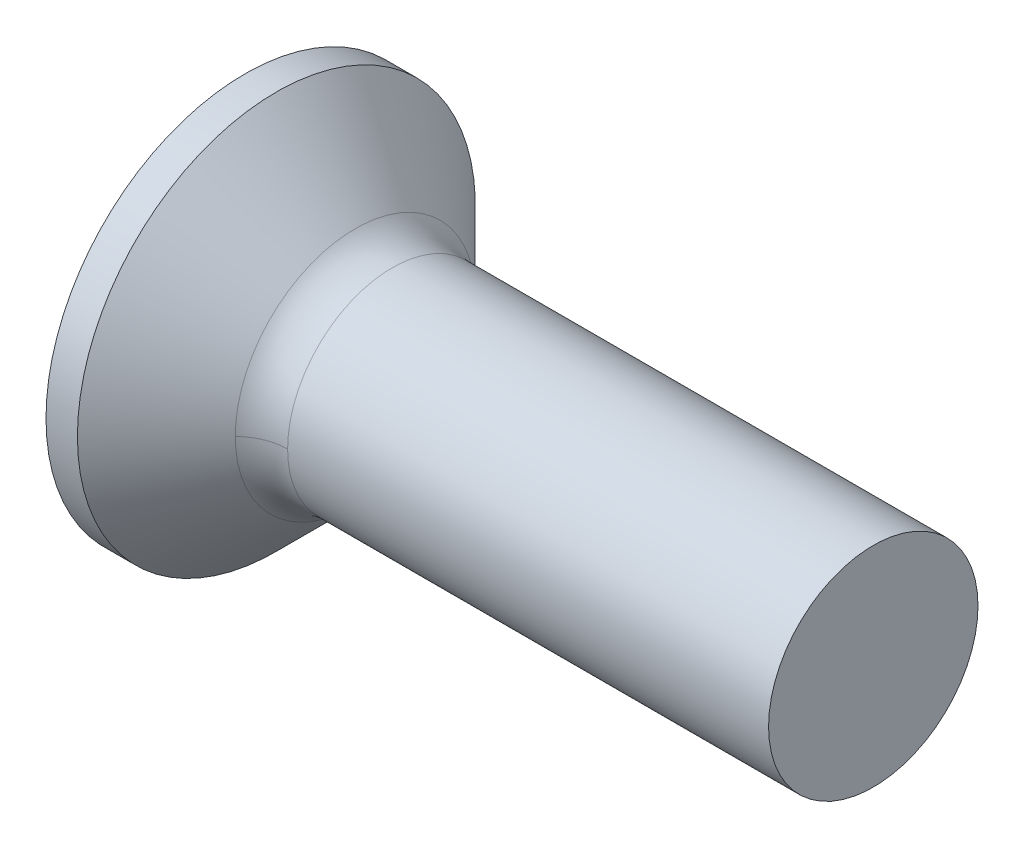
ISO-10303-21;
HEADER;
FILE_DESCRIPTION(('STEP AP214'),'2;1');
FILE_NAME('part.step','',(''),(''),'','','');
FILE_SCHEMA(('AUTOMOTIVE_DESIGN { 1 0 10303 214 1 1 1 1 }'));
ENDSEC;
DATA;
#1=APPLICATION_CONTEXT('core data for automotive mechanical design processes');
#2=APPLICATION_PROTOCOL_DEFINITION('international standard','automotive_design',2000,#1);
#3=PRODUCT_CONTEXT('',#1,'mechanical');
#4=PRODUCT('Part','Part','',(#3));
#5=PRODUCT_RELATED_PRODUCT_CATEGORY('part','',(#4));
#6=PRODUCT_DEFINITION_FORMATION('','',#4);
#7=PRODUCT_DEFINITION_CONTEXT('part definition',#1,'design');
#8=PRODUCT_DEFINITION('design','',#6,#7);
#9=PRODUCT_DEFINITION_SHAPE('','',#8);
#10=(LENGTH_UNIT() NAMED_UNIT(*) SI_UNIT(.MILLI.,.METRE.));
#11=(NAMED_UNIT(*) PLANE_ANGLE_UNIT() SI_UNIT($,.RADIAN.));
#12=(NAMED_UNIT(*) SI_UNIT($,.STERADIAN.) SOLID_ANGLE_UNIT());
#13=UNCERTAINTY_MEASURE_WITH_UNIT(LENGTH_MEASURE(1.E-05),#10,'distance_accuracy_value','');
#14=(GEOMETRIC_REPRESENTATION_CONTEXT(3) GLOBAL_UNCERTAINTY_ASSIGNED_CONTEXT((#13)) GLOBAL_UNIT_ASSIGNED_CONTEXT((#10,
#11,#12)) REPRESENTATION_CONTEXT('',''));
#15=CARTESIAN_POINT('',(0.,0.,0.));
#16=DIRECTION('',(0.,0.,1.));
#17=DIRECTION('',(1.,0.,0.));
#18=AXIS2_PLACEMENT_3D('',#15,#16,#17);
#19=CARTESIAN_POINT('',(6.,-1.012,1.012));
#20=DIRECTION('',(1.,0.,0.));
#21=DIRECTION('',(0.,0.,-1.));
#22=AXIS2_PLACEMENT_3D('',#19,#20,#21);
#23=PLANE('',#22);
#24=CARTESIAN_POINT('',(6.,0.,0.));
#25=DIRECTION('',(-1.,0.,0.));
#26=DIRECTION('',(0.,0.,1.));
#27=AXIS2_PLACEMENT_3D('',#24,#25,#26);
#28=CIRCLE('',#27,1.);
#29=CARTESIAN_POINT('',(6.,0.,1.));
#30=VERTEX_POINT('',#29);
#31=EDGE_CURVE('E20',#30,#30,#28,.F.);
#32=ORIENTED_EDGE('',*,*,#31,.T.);
#33=EDGE_LOOP('',(#32));
#34=FACE_BOUND('',#33,.T.);
#35=ADVANCED_FACE('F16',(#34),#23,.T.);
#36=CARTESIAN_POINT('',(6.,0.,0.));
#37=DIRECTION('',(-1.,0.,0.));
#38=DIRECTION('',(0.,0.,1.));
#39=AXIS2_PLACEMENT_3D('',#36,#37,#38);
#40=CYLINDRICAL_SURFACE('',#39,1.);
#41=ORIENTED_EDGE('',*,*,#31,.F.);
#42=EDGE_LOOP('',(#41));
#43=FACE_BOUND('',#42,.T.);
#44=CARTESIAN_POINT('',(1.40710678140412,0.,0.));
#45=DIRECTION('',(1.,0.,0.));
#46=DIRECTION('',(0.,1.,0.));
#47=AXIS2_PLACEMENT_3D('',#44,#45,#46);
#48=CIRCLE('',#47,0.999999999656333);
#49=CARTESIAN_POINT('',(1.4071067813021,-1.02551714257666E-10,-0.99999999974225));
#50=VERTEX_POINT('',#49);
#51=CARTESIAN_POINT('',(1.40710678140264,-4.48968142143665E-11,0.99999999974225));
#52=VERTEX_POINT('',#51);
#53=EDGE_CURVE('E142',#50,#52,#48,.T.);
#54=ORIENTED_EDGE('',*,*,#53,.T.);
#55=CARTESIAN_POINT('',(1.40710678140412,0.,0.));
#56=DIRECTION('',(1.,0.,0.));
#57=DIRECTION('',(0.,1.,0.));
#58=AXIS2_PLACEMENT_3D('',#55,#56,#57);
#59=CIRCLE('',#58,0.999999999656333);
#60=EDGE_CURVE('E298',#52,#50,#59,.T.);
#61=ORIENTED_EDGE('',*,*,#60,.T.);
#62=EDGE_LOOP('',(#54,#61));
#63=FACE_BOUND('',#62,.T.);
#64=ADVANCED_FACE('F280',(#43,#63),#40,.T.);
#65=CARTESIAN_POINT('',(1.45702349,0.,1.002497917));
#66=CARTESIAN_POINT('',(1.45702349,2.004995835,1.002497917));
#67=CARTESIAN_POINT('',(1.45702349,2.004995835,-1.002497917));
#68=CARTESIAN_POINT('',(1.45702349,0.,-1.002497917));
#69=CARTESIAN_POINT('',(1.286631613,0.,0.985401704));
#70=CARTESIAN_POINT('',(1.286631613,1.970803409,0.985401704));
#71=CARTESIAN_POINT('',(1.286631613,1.970803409,-0.985401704));
#72=CARTESIAN_POINT('',(1.286631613,0.,-0.985401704));
#73=CARTESIAN_POINT('',(1.128419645,0.,1.050935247));
#74=CARTESIAN_POINT('',(1.128419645,2.101870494,1.050935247));
#75=CARTESIAN_POINT('',(1.128419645,2.101870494,-1.050935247));
#76=CARTESIAN_POINT('',(1.128419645,0.,-1.050935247));
#77=CARTESIAN_POINT('',(1.020023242,0.,1.183509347));
#78=CARTESIAN_POINT('',(1.020023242,2.367018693,1.183509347));
#79=CARTESIAN_POINT('',(1.020023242,2.367018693,-1.183509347));
#80=CARTESIAN_POINT('',(1.020023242,0.,-1.183509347));
#81=(BOUNDED_SURFACE() B_SPLINE_SURFACE(3,3,((#65,#66,#67,#68),(#69,#70,#71,#72),(#73,#74,#75,
#76),(#77,#78,#79,#80)),.UNSPECIFIED.,.F.,.F.,.F.) B_SPLINE_SURFACE_WITH_KNOTS((4,4),(4,4),(0.,
1.),(0.,1.),.UNSPECIFIED.) GEOMETRIC_REPRESENTATION_ITEM() RATIONAL_B_SPLINE_SURFACE(((1.,
0.333333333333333,0.333333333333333,1.),(0.920706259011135,0.306902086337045,0.306902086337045,
0.920706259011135),(0.920706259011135,0.306902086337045,0.306902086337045,0.920706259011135),
(1.,0.333333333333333,0.333333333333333,1.))) REPRESENTATION_ITEM('') SURFACE());
#82=CARTESIAN_POINT('',(1.053553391,0.,0.));
#83=DIRECTION('',(-1.,0.,0.));
#84=DIRECTION('',(0.,0.,1.));
#85=AXIS2_PLACEMENT_3D('',#82,#83,#84);
#86=CIRCLE('',#85,1.146446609);
#87=CARTESIAN_POINT('',(1.05355339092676,-3.52710195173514E-10,-1.14644660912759));
#88=VERTEX_POINT('',#87);
#89=CARTESIAN_POINT('',(1.05355339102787,-1.02943600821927E-10,1.14644660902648));
#90=VERTEX_POINT('',#89);
#91=EDGE_CURVE('E307',#88,#90,#86,.F.);
#92=CARTESIAN_POINT('',(1.45702349,0.,1.002497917));
#93=CARTESIAN_POINT('',(1.286631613,0.,0.985401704));
#94=CARTESIAN_POINT('',(1.128419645,0.,1.050935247));
#95=CARTESIAN_POINT('',(1.020023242,0.,1.183509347));
#96=(BOUNDED_CURVE() B_SPLINE_CURVE(3,(#92,#93,#94,#95),.UNSPECIFIED.,.F.,
.F.) B_SPLINE_CURVE_WITH_KNOTS((4,4),(0.,1.),
.UNSPECIFIED.) CURVE() GEOMETRIC_REPRESENTATION_ITEM() RATIONAL_B_SPLINE_CURVE((1.,
0.920706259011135,0.920706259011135,1.)) REPRESENTATION_ITEM(''));
#97=EDGE_CURVE('E299',#90,#52,#96,.F.);
#98=CARTESIAN_POINT('',(1.45702349,0.,-1.002497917));
#99=CARTESIAN_POINT('',(1.286631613,0.,-0.985401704));
#100=CARTESIAN_POINT('',(1.128419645,0.,-1.050935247));
#101=CARTESIAN_POINT('',(1.020023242,0.,-1.183509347));
#102=(BOUNDED_CURVE() B_SPLINE_CURVE(3,(#98,#99,#100,#101),.UNSPECIFIED.,.F.,
.F.) B_SPLINE_CURVE_WITH_KNOTS((4,4),(0.,1.),
.UNSPECIFIED.) CURVE() GEOMETRIC_REPRESENTATION_ITEM() RATIONAL_B_SPLINE_CURVE((1.,
0.920706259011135,0.920706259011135,1.)) REPRESENTATION_ITEM(''));
#103=EDGE_CURVE('E304',#50,#88,#102,.T.);
#104=ORIENTED_EDGE('',*,*,#91,.T.);
#105=ORIENTED_EDGE('',*,*,#97,.T.);
#106=ORIENTED_EDGE('',*,*,#53,.F.);
#107=ORIENTED_EDGE('',*,*,#103,.T.);
#108=EDGE_LOOP('',(#104,#105,#106,#107));
#109=FACE_BOUND('',#108,.T.);
#110=ADVANCED_FACE('F270',(#109),#81,.F.);
#111=CARTESIAN_POINT('',(1.45702349,0.,-1.002497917));
#112=CARTESIAN_POINT('',(1.45702349,-2.004995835,-1.002497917));
#113=CARTESIAN_POINT('',(1.45702349,-2.004995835,1.002497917));
#114=CARTESIAN_POINT('',(1.45702349,0.,1.002497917));
#115=CARTESIAN_POINT('',(1.286631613,0.,-0.985401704));
#116=CARTESIAN_POINT('',(1.286631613,-1.970803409,-0.985401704));
#117=CARTESIAN_POINT('',(1.286631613,-1.970803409,0.985401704));
#118=CARTESIAN_POINT('',(1.286631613,0.,0.985401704));
#119=CARTESIAN_POINT('',(1.128419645,0.,-1.050935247));
#120=CARTESIAN_POINT('',(1.128419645,-2.101870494,-1.050935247));
#121=CARTESIAN_POINT('',(1.128419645,-2.101870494,1.050935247));
#122=CARTESIAN_POINT('',(1.128419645,0.,1.050935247));
#123=CARTESIAN_POINT('',(1.020023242,0.,-1.183509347));
#124=CARTESIAN_POINT('',(1.020023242,-2.367018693,-1.183509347));
#125=CARTESIAN_POINT('',(1.020023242,-2.367018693,1.183509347));
#126=CARTESIAN_POINT('',(1.020023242,0.,1.183509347));
#127=(BOUNDED_SURFACE() B_SPLINE_SURFACE(3,3,((#111,#112,#113,#114),(#115,#116,#117,#118),(#119,
#120,#121,#122),(#123,#124,#125,#126)),.UNSPECIFIED.,.F.,.F.,
.F.) B_SPLINE_SURFACE_WITH_KNOTS((4,4),(4,4),(0.,1.),(0.,1.),
.UNSPECIFIED.) GEOMETRIC_REPRESENTATION_ITEM() RATIONAL_B_SPLINE_SURFACE(((1.,0.333333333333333,
0.333333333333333,1.),(0.920706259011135,0.306902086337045,0.306902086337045,0.920706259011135),
(0.920706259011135,0.306902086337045,0.306902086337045,0.920706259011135),(1.,0.333333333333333,
0.333333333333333,1.))) REPRESENTATION_ITEM('') SURFACE());
#128=CARTESIAN_POINT('',(1.053553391,0.,0.));
#129=DIRECTION('',(-1.,0.,0.));
#130=DIRECTION('',(0.,0.,1.));
#131=AXIS2_PLACEMENT_3D('',#128,#129,#130);
#132=CIRCLE('',#131,1.146446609);
#133=EDGE_CURVE('E463',#90,#88,#132,.F.);
#134=ORIENTED_EDGE('',*,*,#103,.F.);
#135=ORIENTED_EDGE('',*,*,#60,.F.);
#136=ORIENTED_EDGE('',*,*,#97,.F.);
#137=ORIENTED_EDGE('',*,*,#133,.T.);
#138=EDGE_LOOP('',(#134,#135,#136,#137));
#139=FACE_BOUND('',#138,.T.);
#140=ADVANCED_FACE('F218',(#139),#127,.F.);
#141=CARTESIAN_POINT('',(0.,0.95,-0.24));
#142=DIRECTION('',(-0.446197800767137,-0.894934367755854,0.));
#143=DIRECTION('',(0.894934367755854,-0.446197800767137,0.));
#144=AXIS2_PLACEMENT_3D('',#141,#142,#143);
#145=PLANE('',#144);
#146=DIRECTION('',(0.,0.,-1.));
#147=VECTOR('',#146,1.);
#148=CARTESIAN_POINT('',(0.,0.95,0.));
#149=LINE('',#148,#147);
#150=CARTESIAN_POINT('',(0.,0.950000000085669,0.24));
#151=VERTEX_POINT('',#150);
#152=CARTESIAN_POINT('',(0.,0.950000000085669,-0.24));
#153=VERTEX_POINT('',#152);
#154=EDGE_CURVE('E469',#151,#153,#149,.T.);
#155=ORIENTED_EDGE('',*,*,#154,.T.);
#156=DIRECTION('',(-0.89493436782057,0.446197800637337,0.));
#157=VECTOR('',#156,1.);
#158=CARTESIAN_POINT('',(1.2,0.351702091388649,-0.24));
#159=LINE('',#158,#157);
#160=CARTESIAN_POINT('',(1.2,0.351702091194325,-0.24));
#161=VERTEX_POINT('',#160);
#162=EDGE_CURVE('E435',#161,#153,#159,.T.);
#163=ORIENTED_EDGE('',*,*,#162,.F.);
#164=DIRECTION('',(0.,0.,1.));
#165=VECTOR('',#164,1.);
#166=CARTESIAN_POINT('',(1.2,0.351702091,0.));
#167=LINE('',#166,#165);
#168=CARTESIAN_POINT('',(1.2,0.351702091,-0.0518255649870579));
#169=VERTEX_POINT('',#168);
#170=EDGE_CURVE('E132',#161,#169,#167,.T.);
#171=ORIENTED_EDGE('',*,*,#170,.T.);
#172=CARTESIAN_POINT('',(1.19999999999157,0.351702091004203,-0.0518255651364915));
#173=CARTESIAN_POINT('',(1.20098171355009,0.351212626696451,-0.0345503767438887));
#174=CARTESIAN_POINT('',(1.20147257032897,0.350967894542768,-0.0172751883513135));
#175=CARTESIAN_POINT('',(1.20147257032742,0.35096789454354,0.0172751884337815));
#176=CARTESIAN_POINT('',(1.200981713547,0.351212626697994,0.0345503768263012));
#177=CARTESIAN_POINT('',(1.19999999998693,0.351702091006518,0.0518255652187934));
#178=B_SPLINE_CURVE_WITH_KNOTS('',3,(#172,#173,#174,#175,#176,#177),.UNSPECIFIED.,.F.,.F.,(4,2,
4),(0.,0.051851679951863,0.103703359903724),.UNSPECIFIED.);
#179=CARTESIAN_POINT('',(1.19999999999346,0.351702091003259,0.0518255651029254));
#180=VERTEX_POINT('',#179);
#181=EDGE_CURVE('E203',#169,#180,#178,.T.);
#182=ORIENTED_EDGE('',*,*,#181,.T.);
#183=DIRECTION('',(0.,0.,1.));
#184=VECTOR('',#183,1.);
#185=CARTESIAN_POINT('',(1.2,0.351702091,0.));
#186=LINE('',#185,#184);
#187=CARTESIAN_POINT('',(1.2,0.351702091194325,0.24));
#188=VERTEX_POINT('',#187);
#189=EDGE_CURVE('E209',#180,#188,#186,.T.);
#190=ORIENTED_EDGE('',*,*,#189,.T.);
#191=DIRECTION('',(0.89493436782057,-0.446197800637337,0.));
#192=VECTOR('',#191,1.);
#193=CARTESIAN_POINT('',(0.,0.950000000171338,0.24));
#194=LINE('',#193,#192);
#195=EDGE_CURVE('E210',#151,#188,#194,.T.);
#196=ORIENTED_EDGE('',*,*,#195,.F.);
#197=EDGE_LOOP('',(#155,#163,#171,#182,#190,#196));
#198=FACE_BOUND('',#197,.T.);
#199=ADVANCED_FACE('F212',(#198),#145,.T.);
#200=CARTESIAN_POINT('',(1.053553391,0.,0.));
#201=DIRECTION('',(-1.,0.,0.));
#202=DIRECTION('',(0.,-1.,0.));
#203=AXIS2_PLACEMENT_3D('',#200,#201,#202);
#204=CONICAL_SURFACE('',#203,1.146446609,0.785398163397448);
#205=ORIENTED_EDGE('',*,*,#133,.F.);
#206=ORIENTED_EDGE('',*,*,#91,.F.);
#207=EDGE_LOOP('',(#205,#206));
#208=FACE_BOUND('',#207,.T.);
#209=CARTESIAN_POINT('',(0.3,0.,0.));
#210=DIRECTION('',(-1.,0.,0.));
#211=DIRECTION('',(0.,0.,1.));
#212=AXIS2_PLACEMENT_3D('',#209,#210,#211);
#213=CIRCLE('',#212,1.9);
#214=CARTESIAN_POINT('',(0.3,0.,1.9));
#215=VERTEX_POINT('',#214);
#216=EDGE_CURVE('E438',#215,#215,#213,.F.);
#217=ORIENTED_EDGE('',*,*,#216,.T.);
#218=EDGE_LOOP('',(#217));
#219=FACE_BOUND('',#218,.T.);
#220=ADVANCED_FACE('F217',(#208,#219),#204,.T.);
#221=CARTESIAN_POINT('',(0.,0.24,0.25813345));
#222=DIRECTION('',(0.,-1.,0.));
#223=DIRECTION('',(1.,0.,0.));
#224=AXIS2_PLACEMENT_3D('',#221,#222,#223);
#225=PLANE('',#224);
#226=DIRECTION('',(0.,0.,1.));
#227=VECTOR('',#226,1.);
#228=CARTESIAN_POINT('',(1.2,0.24,0.306712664));
#229=LINE('',#228,#227);
#230=CARTESIAN_POINT('',(1.19999999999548,0.240000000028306,0.262259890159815));
#231=VERTEX_POINT('',#230);
#232=CARTESIAN_POINT('',(1.2,0.24,0.351702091));
#233=VERTEX_POINT('',#232);
#234=EDGE_CURVE('E414',#231,#233,#229,.T.);
#235=ORIENTED_EDGE('',*,*,#234,.T.);
#236=DIRECTION('',(0.894934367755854,0.,-0.446197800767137));
#237=VECTOR('',#236,1.);
#238=CARTESIAN_POINT('',(0.6,0.24,0.6508510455));
#239=LINE('',#238,#237);
#240=CARTESIAN_POINT('',(6.27194332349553E-11,0.240000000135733,0.949999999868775));
#241=VERTEX_POINT('',#240);
#242=EDGE_CURVE('E419',#241,#233,#239,.T.);
#243=ORIENTED_EDGE('',*,*,#242,.F.);
#244=DIRECTION('',(0.,0.,-1.));
#245=VECTOR('',#244,1.);
#246=CARTESIAN_POINT('',(0.,0.24,0.6061299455));
#247=LINE('',#246,#245);
#248=CARTESIAN_POINT('',(-2.18694197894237E-11,0.24,0.368080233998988));
#249=VERTEX_POINT('',#248);
#250=EDGE_CURVE('E461',#241,#249,#247,.T.);
#251=ORIENTED_EDGE('',*,*,#250,.T.);
#252=CARTESIAN_POINT('',(1.19999999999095,0.24,0.262259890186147));
#253=CARTESIAN_POINT('',(1.08971854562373,0.24,0.272702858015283));
#254=CARTESIAN_POINT('',(0.979412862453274,0.24,0.282884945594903));
#255=CARTESIAN_POINT('',(0.758765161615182,0.24,0.302838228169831));
#256=CARTESIAN_POINT('',(0.648423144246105,0.24,0.312609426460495));
#257=CARTESIAN_POINT('',(0.448405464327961,0.24,0.330047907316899));
#258=CARTESIAN_POINT('',(0.358734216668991,0.24,0.33776614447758));
#259=CARTESIAN_POINT('',(0.179377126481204,0.24,0.353038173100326));
#260=CARTESIAN_POINT('',(0.0896912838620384,0.24,0.360591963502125));
#261=CARTESIAN_POINT('',(-4.41199682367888E-11,0.24,0.368080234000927));
#262=B_SPLINE_CURVE_WITH_KNOTS('',3,(#252,#253,#254,#255,#256,#257,#258,#259,#260,#261),
.UNSPECIFIED.,.F.,.F.,(4,2,2,2,4),(0.,0.33232339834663,0.664644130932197,0.934652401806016,
1.20466241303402),.UNSPECIFIED.);
#263=EDGE_CURVE('E229',#231,#249,#262,.T.);
#264=ORIENTED_EDGE('',*,*,#263,.F.);
#265=EDGE_LOOP('',(#235,#243,#251,#264));
#266=FACE_BOUND('',#265,.T.);
#267=ADVANCED_FACE('F220',(#266),#225,.T.);
#268=CARTESIAN_POINT('',(0.,0.25813345,0.24));
#269=DIRECTION('',(0.,0.,-1.));
#270=DIRECTION('',(0.,1.,0.));
#271=AXIS2_PLACEMENT_3D('',#268,#269,#270);
#272=PLANE('',#271);
#273=DIRECTION('',(0.,1.,0.));
#274=VECTOR('',#273,1.);
#275=CARTESIAN_POINT('',(0.,0.6061299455,0.24));
#276=LINE('',#275,#274);
#277=CARTESIAN_POINT('',(-2.26855734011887E-11,0.368080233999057,0.24));
#278=VERTEX_POINT('',#277);
#279=EDGE_CURVE('E457',#278,#151,#276,.T.);
#280=ORIENTED_EDGE('',*,*,#279,.T.);
#281=ORIENTED_EDGE('',*,*,#195,.T.);
#282=DIRECTION('',(0.,-1.,0.));
#283=VECTOR('',#282,1.);
#284=CARTESIAN_POINT('',(1.2,0.6061299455,0.24));
#285=LINE('',#284,#283);
#286=CARTESIAN_POINT('',(1.19999999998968,0.26225989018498,0.240000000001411));
#287=VERTEX_POINT('',#286);
#288=EDGE_CURVE('E459',#188,#287,#285,.T.);
#289=ORIENTED_EDGE('',*,*,#288,.T.);
#290=CARTESIAN_POINT('',(-3.7261180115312E-11,0.368080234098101,0.240000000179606));
#291=CARTESIAN_POINT('',(0.136445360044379,0.356678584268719,0.240000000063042));
#292=CARTESIAN_POINT('',(0.272879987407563,0.345141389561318,0.240000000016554));
#293=CARTESIAN_POINT('',(0.545710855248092,0.321640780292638,0.239999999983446));
#294=CARTESIAN_POINT('',(0.682107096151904,0.309677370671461,0.239999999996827));
#295=CARTESIAN_POINT('',(0.882077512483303,0.291708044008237,0.24000000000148));
#296=CARTESIAN_POINT('',(0.945672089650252,0.28592967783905,0.24000000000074));
#297=CARTESIAN_POINT('',(1.07284731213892,0.274218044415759,0.23999999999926));
#298=CARTESIAN_POINT('',(1.13642795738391,0.268284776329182,0.23999999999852));
#299=CARTESIAN_POINT('',(1.19999999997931,0.262259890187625,0.24));
#300=B_SPLINE_CURVE_WITH_KNOTS('',3,(#290,#291,#292,#293,#294,#295,#296,#297,#298,#299),
.UNSPECIFIED.,.F.,.F.,(4,2,2,2,4),(0.,0.410763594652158,0.821522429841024,1.013091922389,
1.20466244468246),.UNSPECIFIED.);
#301=EDGE_CURVE('E237',#278,#287,#300,.T.);
#302=ORIENTED_EDGE('',*,*,#301,.F.);
#303=EDGE_LOOP('',(#280,#281,#289,#302));
#304=FACE_BOUND('',#303,.T.);
#305=ADVANCED_FACE('F224',(#304),#272,.T.);
#306=CARTESIAN_POINT('',(0.,0.24,-0.954126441));
#307=DIRECTION('',(0.,-1.,0.));
#308=DIRECTION('',(1.,0.,0.));
#309=AXIS2_PLACEMENT_3D('',#306,#307,#308);
#310=PLANE('',#309);
#311=DIRECTION('',(0.,0.,-1.));
#312=VECTOR('',#311,1.);
#313=CARTESIAN_POINT('',(0.,0.24,-0.6061299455));
#314=LINE('',#313,#312);
#315=CARTESIAN_POINT('',(-1.95224994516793E-11,0.24,-0.368080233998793));
#316=VERTEX_POINT('',#315);
#317=CARTESIAN_POINT('',(0.,0.24,-0.950000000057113));
#318=VERTEX_POINT('',#317);
#319=EDGE_CURVE('E448',#316,#318,#314,.T.);
#320=ORIENTED_EDGE('',*,*,#319,.T.);
#321=DIRECTION('',(-0.894934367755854,0.,-0.446197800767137));
#322=VECTOR('',#321,1.);
#323=CARTESIAN_POINT('',(0.6,0.24,-0.6508510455));
#324=LINE('',#323,#322);
#325=CARTESIAN_POINT('',(1.2,0.24,-0.35170209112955));
#326=VERTEX_POINT('',#325);
#327=EDGE_CURVE('E439',#326,#318,#324,.T.);
#328=ORIENTED_EDGE('',*,*,#327,.F.);
#329=DIRECTION('',(0.,0.,1.));
#330=VECTOR('',#329,1.);
#331=CARTESIAN_POINT('',(1.2,0.24,-0.6061299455));
#332=LINE('',#331,#330);
#333=CARTESIAN_POINT('',(1.19999999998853,0.239999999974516,-0.262259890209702));
#334=VERTEX_POINT('',#333);
#335=EDGE_CURVE('E451',#326,#334,#332,.T.);
#336=ORIENTED_EDGE('',*,*,#335,.T.);
#337=CARTESIAN_POINT('',(-3.90449931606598E-11,0.24,-0.368080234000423));
#338=CARTESIAN_POINT('',(0.136445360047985,0.24,-0.356678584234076));
#339=CARTESIAN_POINT('',(0.272879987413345,0.24,-0.345141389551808));
#340=CARTESIAN_POINT('',(0.545710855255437,0.24,-0.321640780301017));
#341=CARTESIAN_POINT('',(0.682107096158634,0.24,-0.309677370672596));
#342=CARTESIAN_POINT('',(0.882077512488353,0.24,-0.291708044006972));
#343=CARTESIAN_POINT('',(0.945672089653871,0.24,-0.285929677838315));
#344=CARTESIAN_POINT('',(1.07284731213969,0.24,-0.27421804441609));
#345=CARTESIAN_POINT('',(1.13642795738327,0.24,-0.268284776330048));
#346=CARTESIAN_POINT('',(1.19999999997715,0.24,-0.26225989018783));
#347=B_SPLINE_CURVE_WITH_KNOTS('',3,(#337,#338,#339,#340,#341,#342,#343,#344,#345,#346),
.UNSPECIFIED.,.F.,.F.,(4,2,2,2,4),(0.,0.410763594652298,0.821522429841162,1.01309192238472,
1.20466244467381),.UNSPECIFIED.);
#348=EDGE_CURVE('E407',#316,#334,#347,.T.);
#349=ORIENTED_EDGE('',*,*,#348,.F.);
#350=EDGE_LOOP('',(#320,#328,#336,#349));
#351=FACE_BOUND('',#350,.T.);
#352=ADVANCED_FACE('F501',(#351),#310,.T.);
#353=CARTESIAN_POINT('',(0.,0.25813345,-0.24));
#354=DIRECTION('',(0.,0.,1.));
#355=DIRECTION('',(1.,0.,0.));
#356=AXIS2_PLACEMENT_3D('',#353,#354,#355);
#357=PLANE('',#356);
#358=DIRECTION('',(0.,1.,0.));
#359=VECTOR('',#358,1.);
#360=CARTESIAN_POINT('',(1.2,0.306712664,-0.24));
#361=LINE('',#360,#359);
#362=CARTESIAN_POINT('',(1.19999999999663,0.262259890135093,-0.240000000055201));
#363=VERTEX_POINT('',#362);
#364=EDGE_CURVE('E404',#363,#161,#361,.T.);
#365=ORIENTED_EDGE('',*,*,#364,.T.);
#366=ORIENTED_EDGE('',*,*,#162,.T.);
#367=DIRECTION('',(0.,-1.,0.));
#368=VECTOR('',#367,1.);
#369=CARTESIAN_POINT('',(0.,0.6061299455,-0.24));
#370=LINE('',#369,#368);
#371=CARTESIAN_POINT('',(-2.10532650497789E-11,0.36808023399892,-0.24));
#372=VERTEX_POINT('',#371);
#373=EDGE_CURVE('E446',#153,#372,#370,.T.);
#374=ORIENTED_EDGE('',*,*,#373,.T.);
#375=CARTESIAN_POINT('',(1.19999999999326,0.262259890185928,-0.24));
#376=CARTESIAN_POINT('',(1.08971854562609,0.272702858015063,-0.24));
#377=CARTESIAN_POINT('',(0.979412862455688,0.282884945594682,-0.24));
#378=CARTESIAN_POINT('',(0.758765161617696,0.302838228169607,-0.24));
#379=CARTESIAN_POINT('',(0.648423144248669,0.312609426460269,-0.24));
#380=CARTESIAN_POINT('',(0.448405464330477,0.330047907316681,-0.24));
#381=CARTESIAN_POINT('',(0.358734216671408,0.337766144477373,-0.24));
#382=CARTESIAN_POINT('',(0.179377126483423,0.353038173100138,-0.24));
#383=CARTESIAN_POINT('',(0.0896912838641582,0.360591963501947,-0.24));
#384=CARTESIAN_POINT('',(-4.20991998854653E-11,0.368080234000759,-0.24));
#385=B_SPLINE_CURVE_WITH_KNOTS('',3,(#375,#376,#377,#378,#379,#380,#381,#382,#383,#384),
.UNSPECIFIED.,.F.,.F.,(4,2,2,2,4),(0.,0.332323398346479,0.664644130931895,0.934652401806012,
1.20466241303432),.UNSPECIFIED.);
#386=EDGE_CURVE('E397',#363,#372,#385,.T.);
#387=ORIENTED_EDGE('',*,*,#386,.F.);
#388=EDGE_LOOP('',(#365,#366,#374,#387));
#389=FACE_BOUND('',#388,.T.);
#390=ADVANCED_FACE('F497',(#389),#357,.T.);
#391=CARTESIAN_POINT('',(1.2,0.24,-0.351702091));
#392=DIRECTION('',(-0.446197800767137,0.,0.894934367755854));
#393=DIRECTION('',(-0.894934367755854,0.,-0.446197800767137));
#394=AXIS2_PLACEMENT_3D('',#391,#392,#393);
#395=PLANE('',#394);
#396=DIRECTION('',(0.,-1.,0.));
#397=VECTOR('',#396,1.);
#398=CARTESIAN_POINT('',(0.,0.,-0.95));
#399=LINE('',#398,#397);
#400=CARTESIAN_POINT('',(1.71044818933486E-11,-0.2400000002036,-0.950000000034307));
#401=VERTEX_POINT('',#400);
#402=EDGE_CURVE('E436',#318,#401,#399,.T.);
#403=ORIENTED_EDGE('',*,*,#402,.T.);
#404=DIRECTION('',(-0.89493436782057,0.,-0.446197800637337));
#405=VECTOR('',#404,1.);
#406=CARTESIAN_POINT('',(1.2,-0.24,-0.351702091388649));
#407=LINE('',#406,#405);
#408=CARTESIAN_POINT('',(1.2,-0.24,-0.351702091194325));
#409=VERTEX_POINT('',#408);
#410=EDGE_CURVE('E396',#409,#401,#407,.T.);
#411=ORIENTED_EDGE('',*,*,#410,.F.);
#412=DIRECTION('',(0.,1.,0.));
#413=VECTOR('',#412,1.);
#414=CARTESIAN_POINT('',(1.2,0.,-0.351702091));
#415=LINE('',#414,#413);
#416=CARTESIAN_POINT('',(1.2,-0.0518255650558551,-0.351702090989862));
#417=VERTEX_POINT('',#416);
#418=EDGE_CURVE('E432',#409,#417,#415,.T.);
#419=ORIENTED_EDGE('',*,*,#418,.T.);
#420=CARTESIAN_POINT('',(1.81755035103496,0.,-0.0438028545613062));
#421=DIRECTION('',(-0.446197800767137,0.,0.894934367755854));
#422=DIRECTION('',(-0.894934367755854,0.,-0.446197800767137));
#423=AXIS2_PLACEMENT_3D('',#420,#421,#422);
#424=ELLIPSE('',#423,0.699951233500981,0.309229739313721);
#425=CARTESIAN_POINT('',(1.19770772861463,0.0256605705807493,-0.353783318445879));
#426=VERTEX_POINT('',#425);
#427=EDGE_CURVE('E434',#417,#426,#424,.F.);
#428=ORIENTED_EDGE('',*,*,#427,.T.);
#429=DIRECTION('',(0.,1.,0.));
#430=VECTOR('',#429,1.);
#431=CARTESIAN_POINT('',(1.2,0.1453482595,-0.351702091));
#432=LINE('',#431,#430);
#433=EDGE_CURVE('E393',#426,#326,#432,.T.);
#434=ORIENTED_EDGE('',*,*,#433,.T.);
#435=ORIENTED_EDGE('',*,*,#327,.T.);
#436=EDGE_LOOP('',(#403,#411,#419,#428,#434,#435));
#437=FACE_BOUND('',#436,.T.);
#438=ADVANCED_FACE('F261',(#437),#395,.T.);
#439=CARTESIAN_POINT('',(0.3,0.,0.));
#440=DIRECTION('',(-1.,0.,0.));
#441=DIRECTION('',(0.,0.,1.));
#442=AXIS2_PLACEMENT_3D('',#439,#440,#441);
#443=CYLINDRICAL_SURFACE('',#442,1.9);
#444=ORIENTED_EDGE('',*,*,#216,.F.);
#445=EDGE_LOOP('',(#444));
#446=FACE_BOUND('',#445,.T.);
#447=CARTESIAN_POINT('',(0.,0.,0.));
#448=DIRECTION('',(-1.,0.,0.));
#449=DIRECTION('',(0.,0.,1.));
#450=AXIS2_PLACEMENT_3D('',#447,#448,#449);
#451=CIRCLE('',#450,1.9);
#452=CARTESIAN_POINT('',(0.,0.,1.9));
#453=VERTEX_POINT('',#452);
#454=EDGE_CURVE('E380',#453,#453,#451,.T.);
#455=ORIENTED_EDGE('',*,*,#454,.F.);
#456=EDGE_LOOP('',(#455));
#457=FACE_BOUND('',#456,.T.);
#458=ADVANCED_FACE('F256',(#446,#457),#443,.T.);
#459=CARTESIAN_POINT('',(0.,0.24,0.95));
#460=DIRECTION('',(-0.446197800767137,0.,-0.894934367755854));
#461=DIRECTION('',(0.894934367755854,0.,-0.446197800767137));
#462=AXIS2_PLACEMENT_3D('',#459,#460,#461);
#463=PLANE('',#462);
#464=DIRECTION('',(0.,-1.,0.));
#465=VECTOR('',#464,1.);
#466=CARTESIAN_POINT('',(0.,0.,0.9499999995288));
#467=LINE('',#466,#465);
#468=CARTESIAN_POINT('',(0.,-0.24,0.949999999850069));
#469=VERTEX_POINT('',#468);
#470=EDGE_CURVE('E373',#241,#469,#467,.T.);
#471=ORIENTED_EDGE('',*,*,#470,.F.);
#472=ORIENTED_EDGE('',*,*,#242,.T.);
#473=DIRECTION('',(0.,-1.,0.));
#474=VECTOR('',#473,1.);
#475=CARTESIAN_POINT('',(1.2,0.1453482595,0.351702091));
#476=LINE('',#475,#474);
#477=CARTESIAN_POINT('',(1.20000000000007,0.0518255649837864,0.35170209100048));
#478=VERTEX_POINT('',#477);
#479=EDGE_CURVE('E238',#233,#478,#476,.T.);
#480=ORIENTED_EDGE('',*,*,#479,.T.);
#481=CARTESIAN_POINT('',(1.81755035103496,0.,0.0438028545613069));
#482=DIRECTION('',(-0.446197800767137,0.,-0.894934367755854));
#483=DIRECTION('',(-0.894934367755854,0.,0.446197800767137));
#484=AXIS2_PLACEMENT_3D('',#481,#482,#483);
#485=ELLIPSE('',#484,0.69995123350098,0.30922973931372);
#486=CARTESIAN_POINT('',(1.20000000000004,-0.0518255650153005,0.351702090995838));
#487=VERTEX_POINT('',#486);
#488=EDGE_CURVE('E243',#478,#487,#485,.F.);
#489=ORIENTED_EDGE('',*,*,#488,.T.);
#490=DIRECTION('',(0.,-1.,0.));
#491=VECTOR('',#490,1.);
#492=CARTESIAN_POINT('',(1.2,0.,0.351702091));
#493=LINE('',#492,#491);
#494=CARTESIAN_POINT('',(1.2,-0.24,0.351702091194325));
#495=VERTEX_POINT('',#494);
#496=EDGE_CURVE('E422',#487,#495,#493,.T.);
#497=ORIENTED_EDGE('',*,*,#496,.T.);
#498=DIRECTION('',(0.89493436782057,0.,-0.446197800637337));
#499=VECTOR('',#498,1.);
#500=CARTESIAN_POINT('',(0.,-0.24,0.950000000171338));
#501=LINE('',#500,#499);
#502=EDGE_CURVE('E366',#469,#495,#501,.T.);
#503=ORIENTED_EDGE('',*,*,#502,.F.);
#504=EDGE_LOOP('',(#471,#472,#480,#489,#497,#503));
#505=FACE_BOUND('',#504,.T.);
#506=ADVANCED_FACE('F260',(#505),#463,.T.);
#507=CARTESIAN_POINT('',(1.2,0.050696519,0.351702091));
#508=DIRECTION('',(1.,0.,0.));
#509=DIRECTION('',(0.,0.,-1.));
#510=AXIS2_PLACEMENT_3D('',#507,#508,#509);
#511=PLANE('',#510);
#512=ORIENTED_EDGE('',*,*,#479,.F.);
#513=ORIENTED_EDGE('',*,*,#234,.F.);
#514=CARTESIAN_POINT('',(1.2,0.,0.));
#515=DIRECTION('',(-1.,0.,0.));
#516=DIRECTION('',(0.,0.,1.));
#517=AXIS2_PLACEMENT_3D('',#514,#515,#516);
#518=CIRCLE('',#517,0.3555);
#519=EDGE_CURVE('E365',#478,#231,#518,.T.);
#520=ORIENTED_EDGE('',*,*,#519,.F.);
#521=EDGE_LOOP('',(#512,#513,#520));
#522=FACE_BOUND('',#521,.T.);
#523=ADVANCED_FACE('F251',(#522),#511,.F.);
#524=CARTESIAN_POINT('',(1.2,0.,0.));
#525=DIRECTION('',(-1.,0.,0.));
#526=DIRECTION('',(0.,0.,1.));
#527=AXIS2_PLACEMENT_3D('',#524,#525,#526);
#528=CONICAL_SURFACE('',#527,0.3555,0.0698131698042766);
#529=CARTESIAN_POINT('',(0.,0.,0.));
#530=DIRECTION('',(-1.,0.,0.));
#531=DIRECTION('',(0.,0.,1.));
#532=AXIS2_PLACEMENT_3D('',#529,#530,#531);
#533=CIRCLE('',#532,0.439412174);
#534=EDGE_CURVE('E425',#278,#249,#533,.F.);
#535=ORIENTED_EDGE('',*,*,#534,.F.);
#536=ORIENTED_EDGE('',*,*,#301,.T.);
#537=CARTESIAN_POINT('',(1.20000000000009,0.,0.));
#538=DIRECTION('',(-1.,0.,0.));
#539=DIRECTION('',(-2.53132996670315E-13,0.,1.));
#540=AXIS2_PLACEMENT_3D('',#537,#538,#539);
#541=CIRCLE('',#540,0.3555);
#542=EDGE_CURVE('E408',#231,#287,#541,.T.);
#543=ORIENTED_EDGE('',*,*,#542,.F.);
#544=ORIENTED_EDGE('',*,*,#263,.T.);
#545=EDGE_LOOP('',(#535,#536,#543,#544));
#546=FACE_BOUND('',#545,.T.);
#547=ADVANCED_FACE('F245',(#546),#528,.F.);
#548=CARTESIAN_POINT('',(1.2,0.261723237,0.24));
#549=DIRECTION('',(1.,0.,0.));
#550=DIRECTION('',(0.,0.,-1.));
#551=AXIS2_PLACEMENT_3D('',#548,#549,#550);
#552=PLANE('',#551);
#553=ORIENTED_EDGE('',*,*,#288,.F.);
#554=ORIENTED_EDGE('',*,*,#189,.F.);
#555=CARTESIAN_POINT('',(1.2,0.,0.));
#556=DIRECTION('',(-1.,0.,0.));
#557=DIRECTION('',(0.,0.,1.));
#558=AXIS2_PLACEMENT_3D('',#555,#556,#557);
#559=CIRCLE('',#558,0.3555);
#560=EDGE_CURVE('E411',#287,#180,#559,.T.);
#561=ORIENTED_EDGE('',*,*,#560,.F.);
#562=EDGE_LOOP('',(#553,#554,#561));
#563=FACE_BOUND('',#562,.T.);
#564=ADVANCED_FACE('F250',(#563),#552,.F.);
#565=CARTESIAN_POINT('',(1.2,0.261723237,-0.050696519));
#566=DIRECTION('',(1.,0.,0.));
#567=DIRECTION('',(0.,0.,-1.));
#568=AXIS2_PLACEMENT_3D('',#565,#566,#567);
#569=PLANE('',#568);
#570=ORIENTED_EDGE('',*,*,#170,.F.);
#571=ORIENTED_EDGE('',*,*,#364,.F.);
#572=CARTESIAN_POINT('',(1.2,0.,0.));
#573=DIRECTION('',(-1.,0.,0.));
#574=DIRECTION('',(0.,0.,1.));
#575=AXIS2_PLACEMENT_3D('',#572,#573,#574);
#576=CIRCLE('',#575,0.3555);
#577=EDGE_CURVE('E403',#169,#363,#576,.T.);
#578=ORIENTED_EDGE('',*,*,#577,.F.);
#579=EDGE_LOOP('',(#570,#571,#578));
#580=FACE_BOUND('',#579,.T.);
#581=ADVANCED_FACE('F515',(#580),#569,.F.);
#582=CARTESIAN_POINT('',(1.2,0.,0.));
#583=DIRECTION('',(-1.,0.,0.));
#584=DIRECTION('',(0.,0.,1.));
#585=AXIS2_PLACEMENT_3D('',#582,#583,#584);
#586=CONICAL_SURFACE('',#585,0.3555,0.0698131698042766);
#587=CARTESIAN_POINT('',(1.20000000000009,0.,0.));
#588=DIRECTION('',(-1.,0.,0.));
#589=DIRECTION('',(-2.53132996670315E-13,0.,1.));
#590=AXIS2_PLACEMENT_3D('',#587,#588,#589);
#591=CIRCLE('',#590,0.3555);
#592=EDGE_CURVE('E400',#363,#334,#591,.T.);
#593=ORIENTED_EDGE('',*,*,#592,.F.);
#594=ORIENTED_EDGE('',*,*,#386,.T.);
#595=CARTESIAN_POINT('',(0.,0.,0.));
#596=DIRECTION('',(-1.,0.,0.));
#597=DIRECTION('',(0.,0.,1.));
#598=AXIS2_PLACEMENT_3D('',#595,#596,#597);
#599=CIRCLE('',#598,0.439412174);
#600=EDGE_CURVE('E377',#316,#372,#599,.F.);
#601=ORIENTED_EDGE('',*,*,#600,.F.);
#602=ORIENTED_EDGE('',*,*,#348,.T.);
#603=EDGE_LOOP('',(#593,#594,#601,#602));
#604=FACE_BOUND('',#603,.T.);
#605=ADVANCED_FACE('F253',(#604),#586,.F.);
#606=CARTESIAN_POINT('',(1.2,0.050696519,-0.261723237));
#607=DIRECTION('',(1.,0.,0.));
#608=DIRECTION('',(0.,0.,-1.));
#609=AXIS2_PLACEMENT_3D('',#606,#607,#608);
#610=PLANE('',#609);
#611=ORIENTED_EDGE('',*,*,#335,.F.);
#612=ORIENTED_EDGE('',*,*,#433,.F.);
#613=CARTESIAN_POINT('',(1.2,0.,0.));
#614=DIRECTION('',(-1.,0.,0.));
#615=DIRECTION('',(0.,0.,1.));
#616=AXIS2_PLACEMENT_3D('',#613,#614,#615);
#617=CIRCLE('',#616,0.3555);
#618=EDGE_CURVE('E356',#334,#426,#617,.T.);
#619=ORIENTED_EDGE('',*,*,#618,.F.);
#620=EDGE_LOOP('',(#611,#612,#619));
#621=FACE_BOUND('',#620,.T.);
#622=ADVANCED_FACE('F520',(#621),#610,.F.);
#623=CARTESIAN_POINT('',(0.,-0.24,-0.954126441));
#624=DIRECTION('',(0.,1.,0.));
#625=DIRECTION('',(0.,0.,1.));
#626=AXIS2_PLACEMENT_3D('',#623,#624,#625);
#627=PLANE('',#626);
#628=DIRECTION('',(0.,0.,-1.));
#629=VECTOR('',#628,1.);
#630=CARTESIAN_POINT('',(1.2,-0.24,-0.306712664));
#631=LINE('',#630,#629);
#632=CARTESIAN_POINT('',(1.20000000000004,-0.239999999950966,-0.262259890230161));
#633=VERTEX_POINT('',#632);
#634=EDGE_CURVE('E352',#633,#409,#631,.T.);
#635=ORIENTED_EDGE('',*,*,#634,.T.);
#636=ORIENTED_EDGE('',*,*,#410,.T.);
#637=DIRECTION('',(0.,0.,-1.));
#638=VECTOR('',#637,1.);
#639=CARTESIAN_POINT('',(0.,-0.2400000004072,0.));
#640=LINE('',#639,#638);
#641=CARTESIAN_POINT('',(-2.29057066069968E-11,-0.2400000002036,-0.368080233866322));
#642=VERTEX_POINT('',#641);
#643=EDGE_CURVE('E374',#642,#401,#640,.T.);
#644=ORIENTED_EDGE('',*,*,#643,.F.);
#645=CARTESIAN_POINT('',(1.19999999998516,-0.240000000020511,-0.262259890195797));
#646=CARTESIAN_POINT('',(1.08971854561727,-0.240000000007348,-0.272702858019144));
#647=CARTESIAN_POINT('',(0.97941286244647,-0.240000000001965,-0.282884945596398));
#648=CARTESIAN_POINT('',(0.758765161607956,-0.239999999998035,-0.302838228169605));
#649=CARTESIAN_POINT('',(0.648423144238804,-0.239999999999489,-0.312609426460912));
#650=CARTESIAN_POINT('',(0.448405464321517,-0.240000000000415,-0.330047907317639));
#651=CARTESIAN_POINT('',(0.358734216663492,-0.240000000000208,-0.337766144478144));
#652=CARTESIAN_POINT('',(0.179377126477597,-0.239999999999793,-0.353038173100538));
#653=CARTESIAN_POINT('',(0.0896912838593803,-0.239999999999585,-0.360591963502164));
#654=CARTESIAN_POINT('',(-4.58044550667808E-11,-0.24,-0.368080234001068));
#655=B_SPLINE_CURVE_WITH_KNOTS('',3,(#645,#646,#647,#648,#649,#650,#651,#652,#653,#654),
.UNSPECIFIED.,.F.,.F.,(4,2,2,2,4),(0.,0.332323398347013,0.664644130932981,0.934652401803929,
1.20466241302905),.UNSPECIFIED.);
#656=EDGE_CURVE('E355',#633,#642,#655,.T.);
#657=ORIENTED_EDGE('',*,*,#656,.F.);
#658=EDGE_LOOP('',(#635,#636,#644,#657));
#659=FACE_BOUND('',#658,.T.);
#660=ADVANCED_FACE('F523',(#659),#627,.T.);
#661=CARTESIAN_POINT('',(0.,-0.954126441,-0.24));
#662=DIRECTION('',(0.,0.,1.));
#663=DIRECTION('',(1.,0.,0.));
#664=AXIS2_PLACEMENT_3D('',#661,#662,#663);
#665=PLANE('',#664);
#666=DIRECTION('',(0.,1.,0.));
#667=VECTOR('',#666,1.);
#668=CARTESIAN_POINT('',(0.,0.,-0.2400000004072));
#669=LINE('',#668,#667);
#670=CARTESIAN_POINT('',(3.13597527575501E-11,-0.949999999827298,-0.240000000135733));
#671=VERTEX_POINT('',#670);
#672=CARTESIAN_POINT('',(0.,-0.368080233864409,-0.2400000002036));
#673=VERTEX_POINT('',#672);
#674=EDGE_CURVE('E378',#671,#673,#669,.T.);
#675=ORIENTED_EDGE('',*,*,#674,.F.);
#676=DIRECTION('',(-0.894934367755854,-0.446197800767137,0.));
#677=VECTOR('',#676,1.);
#678=CARTESIAN_POINT('',(0.6,-0.6508510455,-0.24));
#679=LINE('',#678,#677);
#680=CARTESIAN_POINT('',(1.2,-0.351702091,-0.24));
#681=VERTEX_POINT('',#680);
#682=EDGE_CURVE('E175',#681,#671,#679,.T.);
#683=ORIENTED_EDGE('',*,*,#682,.F.);
#684=DIRECTION('',(0.,1.,0.));
#685=VECTOR('',#684,1.);
#686=CARTESIAN_POINT('',(1.2,-0.306712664,-0.24));
#687=LINE('',#686,#685);
#688=CARTESIAN_POINT('',(1.20000000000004,-0.262259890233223,-0.23999999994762));
#689=VERTEX_POINT('',#688);
#690=EDGE_CURVE('E171',#681,#689,#687,.T.);
#691=ORIENTED_EDGE('',*,*,#690,.T.);
#692=CARTESIAN_POINT('',(-4.60144781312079E-11,-0.368080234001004,-0.24));
#693=CARTESIAN_POINT('',(0.136445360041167,-0.35667858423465,-0.24));
#694=CARTESIAN_POINT('',(0.272879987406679,-0.345141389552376,-0.24));
#695=CARTESIAN_POINT('',(0.545710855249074,-0.321640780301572,-0.24));
#696=CARTESIAN_POINT('',(0.682107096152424,-0.309677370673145,-0.24));
#697=CARTESIAN_POINT('',(0.882077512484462,-0.291708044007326,-0.24));
#698=CARTESIAN_POINT('',(0.945672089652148,-0.285929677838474,-0.24));
#699=CARTESIAN_POINT('',(1.0728473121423,-0.274218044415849,-0.24));
#700=CARTESIAN_POINT('',(1.13642795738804,-0.268284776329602,-0.24));
#701=CARTESIAN_POINT('',(1.19999999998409,-0.262259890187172,-0.24));
#702=B_SPLINE_CURVE_WITH_KNOTS('',3,(#692,#693,#694,#695,#696,#697,#698,#699,#700,#701),
.UNSPECIFIED.,.F.,.F.,(4,2,2,2,4),(0.,0.410763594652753,0.821522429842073,1.01309192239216,
1.20466244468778),.UNSPECIFIED.);
#703=EDGE_CURVE('E347',#673,#689,#702,.T.);
#704=ORIENTED_EDGE('',*,*,#703,.F.);
#705=EDGE_LOOP('',(#675,#683,#691,#704));
#706=FACE_BOUND('',#705,.T.);
#707=ADVANCED_FACE('F528',(#706),#665,.T.);
#708=CARTESIAN_POINT('',(0.,-1.9228,-1.9228));
#709=DIRECTION('',(-1.,0.,0.));
#710=DIRECTION('',(0.,0.,1.));
#711=AXIS2_PLACEMENT_3D('',#708,#709,#710);
#712=PLANE('',#711);
#713=ORIENTED_EDGE('',*,*,#250,.F.);
#714=ORIENTED_EDGE('',*,*,#470,.T.);
#715=DIRECTION('',(0.,0.,1.));
#716=VECTOR('',#715,1.);
#717=CARTESIAN_POINT('',(0.,-0.24,0.6061299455));
#718=LINE('',#717,#716);
#719=CARTESIAN_POINT('',(0.,-0.24,0.368080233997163));
#720=VERTEX_POINT('',#719);
#721=EDGE_CURVE('E369',#720,#469,#718,.T.);
#722=ORIENTED_EDGE('',*,*,#721,.F.);
#723=CARTESIAN_POINT('',(0.,0.,0.));
#724=DIRECTION('',(-1.,0.,0.));
#725=DIRECTION('',(0.,0.,1.));
#726=AXIS2_PLACEMENT_3D('',#723,#724,#725);
#727=CIRCLE('',#726,0.439412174);
#728=CARTESIAN_POINT('',(-1.94209569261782E-11,-0.368080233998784,0.24));
#729=VERTEX_POINT('',#728);
#730=EDGE_CURVE('E335',#729,#720,#727,.T.);
#731=ORIENTED_EDGE('',*,*,#730,.F.);
#732=DIRECTION('',(0.,1.,0.));
#733=VECTOR('',#732,1.);
#734=CARTESIAN_POINT('',(0.,-0.6061299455,0.24));
#735=LINE('',#734,#733);
#736=CARTESIAN_POINT('',(0.,-0.950000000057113,0.24));
#737=VERTEX_POINT('',#736);
#738=EDGE_CURVE('E363',#737,#729,#735,.T.);
#739=ORIENTED_EDGE('',*,*,#738,.F.);
#740=DIRECTION('',(0.,0.,1.));
#741=VECTOR('',#740,1.);
#742=CARTESIAN_POINT('',(0.,-0.95,0.));
#743=LINE('',#742,#741);
#744=EDGE_CURVE('E384',#671,#737,#743,.T.);
#745=ORIENTED_EDGE('',*,*,#744,.F.);
#746=ORIENTED_EDGE('',*,*,#674,.T.);
#747=CARTESIAN_POINT('',(0.,0.,0.));
#748=DIRECTION('',(-1.,0.,0.));
#749=DIRECTION('',(0.,0.,1.));
#750=AXIS2_PLACEMENT_3D('',#747,#748,#749);
#751=CIRCLE('',#750,0.439412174);
#752=EDGE_CURVE('E539',#642,#673,#751,.T.);
#753=ORIENTED_EDGE('',*,*,#752,.F.);
#754=ORIENTED_EDGE('',*,*,#643,.T.);
#755=ORIENTED_EDGE('',*,*,#402,.F.);
#756=ORIENTED_EDGE('',*,*,#319,.F.);
#757=ORIENTED_EDGE('',*,*,#600,.T.);
#758=ORIENTED_EDGE('',*,*,#373,.F.);
#759=ORIENTED_EDGE('',*,*,#154,.F.);
#760=ORIENTED_EDGE('',*,*,#279,.F.);
#761=ORIENTED_EDGE('',*,*,#534,.T.);
#762=EDGE_LOOP('',(#713,#714,#722,#731,#739,#745,#746,#753,#754,#755,#756,#757,#758,#759,#760,#761));
#763=FACE_BOUND('',#762,.T.);
#764=ORIENTED_EDGE('',*,*,#454,.T.);
#765=EDGE_LOOP('',(#764));
#766=FACE_BOUND('',#765,.T.);
#767=ADVANCED_FACE('F570',(#763,#766),#712,.T.);
#768=CARTESIAN_POINT('',(0.,-0.24,0.25813345));
#769=DIRECTION('',(0.,1.,0.));
#770=DIRECTION('',(0.,0.,1.));
#771=AXIS2_PLACEMENT_3D('',#768,#769,#770);
#772=PLANE('',#771);
#773=ORIENTED_EDGE('',*,*,#721,.T.);
#774=ORIENTED_EDGE('',*,*,#502,.T.);
#775=DIRECTION('',(0.,0.,-1.));
#776=VECTOR('',#775,1.);
#777=CARTESIAN_POINT('',(1.2,-0.24,0.6061299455));
#778=LINE('',#777,#776);
#779=CARTESIAN_POINT('',(1.19999999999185,-0.240000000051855,0.262259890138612));
#780=VERTEX_POINT('',#779);
#781=EDGE_CURVE('E35',#495,#780,#778,.T.);
#782=ORIENTED_EDGE('',*,*,#781,.T.);
#783=CARTESIAN_POINT('',(-4.2309607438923E-11,-0.24,0.368080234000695));
#784=CARTESIAN_POINT('',(0.136445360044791,-0.24,0.356678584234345));
#785=CARTESIAN_POINT('',(0.272879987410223,-0.24,0.345141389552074));
#786=CARTESIAN_POINT('',(0.545710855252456,-0.24,0.321640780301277));
#787=CARTESIAN_POINT('',(0.682107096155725,-0.24,0.309677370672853));
#788=CARTESIAN_POINT('',(0.882077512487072,-0.24,0.291708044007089));
#789=CARTESIAN_POINT('',(0.945672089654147,-0.24,0.285929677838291));
#790=CARTESIAN_POINT('',(1.07284731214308,-0.24,0.274218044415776));
#791=CARTESIAN_POINT('',(1.13642795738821,-0.24,0.268284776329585));
#792=CARTESIAN_POINT('',(1.19999999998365,-0.24,0.262259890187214));
#793=B_SPLINE_CURVE_WITH_KNOTS('',3,(#783,#784,#785,#786,#787,#788,#789,#790,#791,#792),
.UNSPECIFIED.,.F.,.F.,(4,2,2,2,4),(0.,0.410763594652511,0.821522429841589,1.01309192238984,
1.20466244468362),.UNSPECIFIED.);
#794=EDGE_CURVE('E556',#720,#780,#793,.T.);
#795=ORIENTED_EDGE('',*,*,#794,.F.);
#796=EDGE_LOOP('',(#773,#774,#782,#795));
#797=FACE_BOUND('',#796,.T.);
#798=ADVANCED_FACE('F566',(#797),#772,.T.);
#799=CARTESIAN_POINT('',(0.,-0.954126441,0.24));
#800=DIRECTION('',(0.,0.,-1.));
#801=DIRECTION('',(0.,1.,0.));
#802=AXIS2_PLACEMENT_3D('',#799,#800,#801);
#803=PLANE('',#802);
#804=DIRECTION('',(0.,-1.,0.));
#805=VECTOR('',#804,1.);
#806=CARTESIAN_POINT('',(1.2,-0.306712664,0.24));
#807=LINE('',#806,#805);
#808=CARTESIAN_POINT('',(1.19999999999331,-0.262259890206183,0.239999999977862));
#809=VERTEX_POINT('',#808);
#810=CARTESIAN_POINT('',(1.2,-0.351702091,0.24));
#811=VERTEX_POINT('',#810);
#812=EDGE_CURVE('E336',#809,#811,#807,.T.);
#813=ORIENTED_EDGE('',*,*,#812,.T.);
#814=DIRECTION('',(0.894934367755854,0.446197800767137,0.));
#815=VECTOR('',#814,1.);
#816=CARTESIAN_POINT('',(0.6,-0.6508510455,0.24));
#817=LINE('',#816,#815);
#818=EDGE_CURVE('E341',#737,#811,#817,.T.);
#819=ORIENTED_EDGE('',*,*,#818,.F.);
#820=ORIENTED_EDGE('',*,*,#738,.T.);
#821=CARTESIAN_POINT('',(1.19999999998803,-0.262259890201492,0.240000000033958));
#822=CARTESIAN_POINT('',(1.08971854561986,-0.272702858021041,0.240000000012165));
#823=CARTESIAN_POINT('',(0.979412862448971,-0.28288494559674,0.240000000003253));
#824=CARTESIAN_POINT('',(0.758765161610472,-0.302838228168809,0.239999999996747));
#825=CARTESIAN_POINT('',(0.648423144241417,-0.312609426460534,0.239999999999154));
#826=CARTESIAN_POINT('',(0.448405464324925,-0.330047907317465,0.240000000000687));
#827=CARTESIAN_POINT('',(0.358734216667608,-0.33776614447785,0.240000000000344));
#828=CARTESIAN_POINT('',(0.179377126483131,-0.35303817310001,0.239999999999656));
#829=CARTESIAN_POINT('',(0.0896912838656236,-0.360591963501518,0.239999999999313));
#830=CARTESIAN_POINT('',(-3.88348026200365E-11,-0.368080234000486,0.24));
#831=B_SPLINE_CURVE_WITH_KNOTS('',3,(#821,#822,#823,#824,#825,#826,#827,#828,#829,#830),
.UNSPECIFIED.,.F.,.F.,(4,2,2,2,4),(0.,0.332323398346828,0.664644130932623,0.934652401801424,
1.2046624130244),.UNSPECIFIED.);
#832=EDGE_CURVE('E360',#809,#729,#831,.T.);
#833=ORIENTED_EDGE('',*,*,#832,.F.);
#834=EDGE_LOOP('',(#813,#819,#820,#833));
#835=FACE_BOUND('',#834,.T.);
#836=ADVANCED_FACE('F569',(#835),#803,.T.);
#837=CARTESIAN_POINT('',(1.2,0.,0.));
#838=DIRECTION('',(-1.,0.,0.));
#839=DIRECTION('',(0.,0.,1.));
#840=AXIS2_PLACEMENT_3D('',#837,#838,#839);
#841=CONICAL_SURFACE('',#840,0.3555,0.0698131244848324);
#842=ORIENTED_EDGE('',*,*,#427,.F.);
#843=CARTESIAN_POINT('',(1.20000000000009,0.,0.));
#844=DIRECTION('',(-1.,0.,0.));
#845=DIRECTION('',(-2.53132996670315E-13,0.,1.));
#846=AXIS2_PLACEMENT_3D('',#843,#844,#845);
#847=CIRCLE('',#846,0.3555);
#848=EDGE_CURVE('E357',#426,#417,#847,.T.);
#849=ORIENTED_EDGE('',*,*,#848,.F.);
#850=EDGE_LOOP('',(#842,#849));
#851=FACE_BOUND('',#850,.T.);
#852=ADVANCED_FACE('F549',(#851),#841,.F.);
#853=CARTESIAN_POINT('',(1.2,-0.24,-0.261723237));
#854=DIRECTION('',(1.,0.,0.));
#855=DIRECTION('',(0.,0.,-1.));
#856=AXIS2_PLACEMENT_3D('',#853,#854,#855);
#857=PLANE('',#856);
#858=ORIENTED_EDGE('',*,*,#418,.F.);
#859=ORIENTED_EDGE('',*,*,#634,.F.);
#860=CARTESIAN_POINT('',(1.2,0.,0.));
#861=DIRECTION('',(-1.,0.,0.));
#862=DIRECTION('',(0.,0.,1.));
#863=AXIS2_PLACEMENT_3D('',#860,#861,#862);
#864=CIRCLE('',#863,0.3555);
#865=EDGE_CURVE('E351',#417,#633,#864,.T.);
#866=ORIENTED_EDGE('',*,*,#865,.F.);
#867=EDGE_LOOP('',(#858,#859,#866));
#868=FACE_BOUND('',#867,.T.);
#869=ADVANCED_FACE('F545',(#868),#857,.F.);
#870=CARTESIAN_POINT('',(1.2,0.,0.));
#871=DIRECTION('',(-1.,0.,0.));
#872=DIRECTION('',(0.,0.,1.));
#873=AXIS2_PLACEMENT_3D('',#870,#871,#872);
#874=CONICAL_SURFACE('',#873,0.3555,0.0698131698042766);
#875=ORIENTED_EDGE('',*,*,#752,.T.);
#876=ORIENTED_EDGE('',*,*,#703,.T.);
#877=CARTESIAN_POINT('',(1.20000000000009,0.,0.));
#878=DIRECTION('',(-1.,0.,0.));
#879=DIRECTION('',(-2.53132996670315E-13,0.,1.));
#880=AXIS2_PLACEMENT_3D('',#877,#878,#879);
#881=CIRCLE('',#880,0.3555);
#882=EDGE_CURVE('E163',#633,#689,#881,.T.);
#883=ORIENTED_EDGE('',*,*,#882,.F.);
#884=ORIENTED_EDGE('',*,*,#656,.T.);
#885=EDGE_LOOP('',(#875,#876,#883,#884));
#886=FACE_BOUND('',#885,.T.);
#887=ADVANCED_FACE('F542',(#886),#874,.F.);
#888=CARTESIAN_POINT('',(1.2,-0.351702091,-0.050696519));
#889=DIRECTION('',(1.,0.,0.));
#890=DIRECTION('',(0.,0.,-1.));
#891=AXIS2_PLACEMENT_3D('',#888,#889,#890);
#892=PLANE('',#891);
#893=ORIENTED_EDGE('',*,*,#690,.F.);
#894=DIRECTION('',(0.,0.,-1.));
#895=VECTOR('',#894,1.);
#896=CARTESIAN_POINT('',(1.2,-0.351702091,0.));
#897=LINE('',#896,#895);
#898=CARTESIAN_POINT('',(1.2,-0.351702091,-0.0518255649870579));
#899=VERTEX_POINT('',#898);
#900=EDGE_CURVE('E169',#899,#681,#897,.T.);
#901=ORIENTED_EDGE('',*,*,#900,.F.);
#902=CARTESIAN_POINT('',(1.2,0.,0.));
#903=DIRECTION('',(-1.,0.,0.));
#904=DIRECTION('',(0.,0.,1.));
#905=AXIS2_PLACEMENT_3D('',#902,#903,#904);
#906=CIRCLE('',#905,0.3555);
#907=EDGE_CURVE('E153',#689,#899,#906,.T.);
#908=ORIENTED_EDGE('',*,*,#907,.F.);
#909=EDGE_LOOP('',(#893,#901,#908));
#910=FACE_BOUND('',#909,.T.);
#911=ADVANCED_FACE('F170',(#910),#892,.F.);
#912=CARTESIAN_POINT('',(1.2,-0.351702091,-0.24));
#913=DIRECTION('',(-0.446197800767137,0.894934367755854,0.));
#914=DIRECTION('',(-0.894934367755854,-0.446197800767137,0.));
#915=AXIS2_PLACEMENT_3D('',#912,#913,#914);
#916=PLANE('',#915);
#917=ORIENTED_EDGE('',*,*,#744,.T.);
#918=ORIENTED_EDGE('',*,*,#818,.T.);
#919=DIRECTION('',(0.,0.,-1.));
#920=VECTOR('',#919,1.);
#921=CARTESIAN_POINT('',(1.2,-0.351702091,0.1453482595));
#922=LINE('',#921,#920);
#923=CARTESIAN_POINT('',(1.19999999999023,-0.35170209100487,0.0518255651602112));
#924=VERTEX_POINT('',#923);
#925=EDGE_CURVE('E181',#811,#924,#922,.T.);
#926=ORIENTED_EDGE('',*,*,#925,.T.);
#927=CARTESIAN_POINT('',(1.19999999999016,-0.351702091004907,-0.0518255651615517));
#928=CARTESIAN_POINT('',(1.20098171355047,-0.351212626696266,-0.0345503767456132));
#929=CARTESIAN_POINT('',(1.20147257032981,-0.350967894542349,-0.017275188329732));
#930=CARTESIAN_POINT('',(1.20147257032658,-0.350967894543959,0.0172751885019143));
#931=CARTESIAN_POINT('',(1.200981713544,-0.351212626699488,0.0345503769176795));
#932=CARTESIAN_POINT('',(1.19999999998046,-0.35170209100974,0.0518255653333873));
#933=B_SPLINE_CURVE_WITH_KNOTS('',3,(#927,#928,#929,#930,#931,#932),.UNSPECIFIED.,.F.,.F.,(4,2,
4),(0.,0.0518516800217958,0.103703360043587),.UNSPECIFIED.);
#934=EDGE_CURVE('E159',#899,#924,#933,.T.);
#935=ORIENTED_EDGE('',*,*,#934,.F.);
#936=ORIENTED_EDGE('',*,*,#900,.T.);
#937=ORIENTED_EDGE('',*,*,#682,.T.);
#938=EDGE_LOOP('',(#917,#918,#926,#935,#936,#937));
#939=FACE_BOUND('',#938,.T.);
#940=ADVANCED_FACE('F178',(#939),#916,.T.);
#941=CARTESIAN_POINT('',(1.2,-0.351702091,0.24));
#942=DIRECTION('',(1.,0.,0.));
#943=DIRECTION('',(0.,0.,-1.));
#944=AXIS2_PLACEMENT_3D('',#941,#942,#943);
#945=PLANE('',#944);
#946=ORIENTED_EDGE('',*,*,#925,.F.);
#947=ORIENTED_EDGE('',*,*,#812,.F.);
#948=CARTESIAN_POINT('',(1.2,0.,0.));
#949=DIRECTION('',(-1.,0.,0.));
#950=DIRECTION('',(0.,0.,1.));
#951=AXIS2_PLACEMENT_3D('',#948,#949,#950);
#952=CIRCLE('',#951,0.3555);
#953=EDGE_CURVE('E183',#924,#809,#952,.T.);
#954=ORIENTED_EDGE('',*,*,#953,.F.);
#955=EDGE_LOOP('',(#946,#947,#954));
#956=FACE_BOUND('',#955,.T.);
#957=ADVANCED_FACE('F581',(#956),#945,.F.);
#958=CARTESIAN_POINT('',(1.2,0.,0.));
#959=DIRECTION('',(-1.,0.,0.));
#960=DIRECTION('',(0.,0.,1.));
#961=AXIS2_PLACEMENT_3D('',#958,#959,#960);
#962=CONICAL_SURFACE('',#961,0.3555,0.0698131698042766);
#963=CARTESIAN_POINT('',(1.20000000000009,0.,0.));
#964=DIRECTION('',(-1.,0.,0.));
#965=DIRECTION('',(-2.53132996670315E-13,0.,1.));
#966=AXIS2_PLACEMENT_3D('',#963,#964,#965);
#967=CIRCLE('',#966,0.3555);
#968=EDGE_CURVE('E185',#809,#780,#967,.T.);
#969=ORIENTED_EDGE('',*,*,#968,.F.);
#970=ORIENTED_EDGE('',*,*,#832,.T.);
#971=ORIENTED_EDGE('',*,*,#730,.T.);
#972=ORIENTED_EDGE('',*,*,#794,.T.);
#973=EDGE_LOOP('',(#969,#970,#971,#972));
#974=FACE_BOUND('',#973,.T.);
#975=ADVANCED_FACE('F547',(#974),#962,.F.);
#976=CARTESIAN_POINT('',(1.2,-0.24,0.351702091));
#977=DIRECTION('',(1.,0.,0.));
#978=DIRECTION('',(0.,0.,-1.));
#979=AXIS2_PLACEMENT_3D('',#976,#977,#978);
#980=PLANE('',#979);
#981=ORIENTED_EDGE('',*,*,#781,.F.);
#982=ORIENTED_EDGE('',*,*,#496,.F.);
#983=CARTESIAN_POINT('',(1.2,0.,0.));
#984=DIRECTION('',(-1.,0.,0.));
#985=DIRECTION('',(0.,0.,1.));
#986=AXIS2_PLACEMENT_3D('',#983,#984,#985);
#987=CIRCLE('',#986,0.3555);
#988=EDGE_CURVE('E26',#780,#487,#987,.T.);
#989=ORIENTED_EDGE('',*,*,#988,.F.);
#990=EDGE_LOOP('',(#981,#982,#989));
#991=FACE_BOUND('',#990,.T.);
#992=ADVANCED_FACE('F18',(#991),#980,.F.);
#993=CARTESIAN_POINT('',(1.2,0.,0.));
#994=DIRECTION('',(-1.,0.,0.));
#995=DIRECTION('',(0.,0.,1.));
#996=AXIS2_PLACEMENT_3D('',#993,#994,#995);
#997=CONICAL_SURFACE('',#996,0.3555,0.0698131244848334);
#998=CARTESIAN_POINT('',(1.20000000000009,0.,0.));
#999=DIRECTION('',(-1.,0.,0.));
#1000=DIRECTION('',(-2.53132996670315E-13,0.,1.));
#1001=AXIS2_PLACEMENT_3D('',#998,#999,#1000);
#1002=CIRCLE('',#1001,0.3555);
#1003=EDGE_CURVE('E10',#487,#478,#1002,.T.);
#1004=ORIENTED_EDGE('',*,*,#1003,.F.);
#1005=ORIENTED_EDGE('',*,*,#488,.F.);
#1006=EDGE_LOOP('',(#1004,#1005));
#1007=FACE_BOUND('',#1006,.T.);
#1008=ADVANCED_FACE('F199',(#1007),#997,.F.);
#1009=CARTESIAN_POINT('',(1.315508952,0.,0.));
#1010=DIRECTION('',(-1.,0.,0.));
#1011=DIRECTION('',(0.,0.,1.));
#1012=AXIS2_PLACEMENT_3D('',#1009,#1010,#1011);
#1013=CONICAL_SURFACE('',#1012,0.,1.25663706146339);
#1014=CARTESIAN_POINT('',(1.315508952,0.,0.));
#1015=VERTEX_POINT('',#1014);
#1016=VERTEX_LOOP('',#1015);
#1017=FACE_BOUND('',#1016,.T.);
#1018=ORIENTED_EDGE('',*,*,#988,.T.);
#1019=ORIENTED_EDGE('',*,*,#1003,.T.);
#1020=ORIENTED_EDGE('',*,*,#519,.T.);
#1021=ORIENTED_EDGE('',*,*,#542,.T.);
#1022=ORIENTED_EDGE('',*,*,#560,.T.);
#1023=ORIENTED_EDGE('',*,*,#181,.F.);
#1024=ORIENTED_EDGE('',*,*,#577,.T.);
#1025=ORIENTED_EDGE('',*,*,#592,.T.);
#1026=ORIENTED_EDGE('',*,*,#618,.T.);
#1027=ORIENTED_EDGE('',*,*,#848,.T.);
#1028=ORIENTED_EDGE('',*,*,#865,.T.);
#1029=ORIENTED_EDGE('',*,*,#882,.T.);
#1030=ORIENTED_EDGE('',*,*,#907,.T.);
#1031=ORIENTED_EDGE('',*,*,#934,.T.);
#1032=ORIENTED_EDGE('',*,*,#953,.T.);
#1033=ORIENTED_EDGE('',*,*,#968,.T.);
#1034=EDGE_LOOP('',(#1018,#1019,#1020,#1021,#1022,#1023,#1024,#1025,#1026,#1027,#1028,#1029,
#1030,#1031,#1032,#1033));
#1035=FACE_BOUND('',#1034,.T.);
#1036=ADVANCED_FACE('F156',(#1017,#1035),#1013,.F.);
#1037=CLOSED_SHELL('',(#35,#64,#110,#140,#199,#220,#267,#305,#352,#390,#438,#458,#506,#523,#547,
#564,#581,#605,#622,#660,#707,#767,#798,#836,#852,#869,#887,#911,#940,#957,#975,#992,#1008,#1036));
#1038=MANIFOLD_SOLID_BREP('B1',#1037);
#1039=ADVANCED_BREP_SHAPE_REPRESENTATION('',(#18,#1038),#14);
#1040=SHAPE_DEFINITION_REPRESENTATION(#9,#1039);
ENDSEC;
END-ISO-10303-21;
